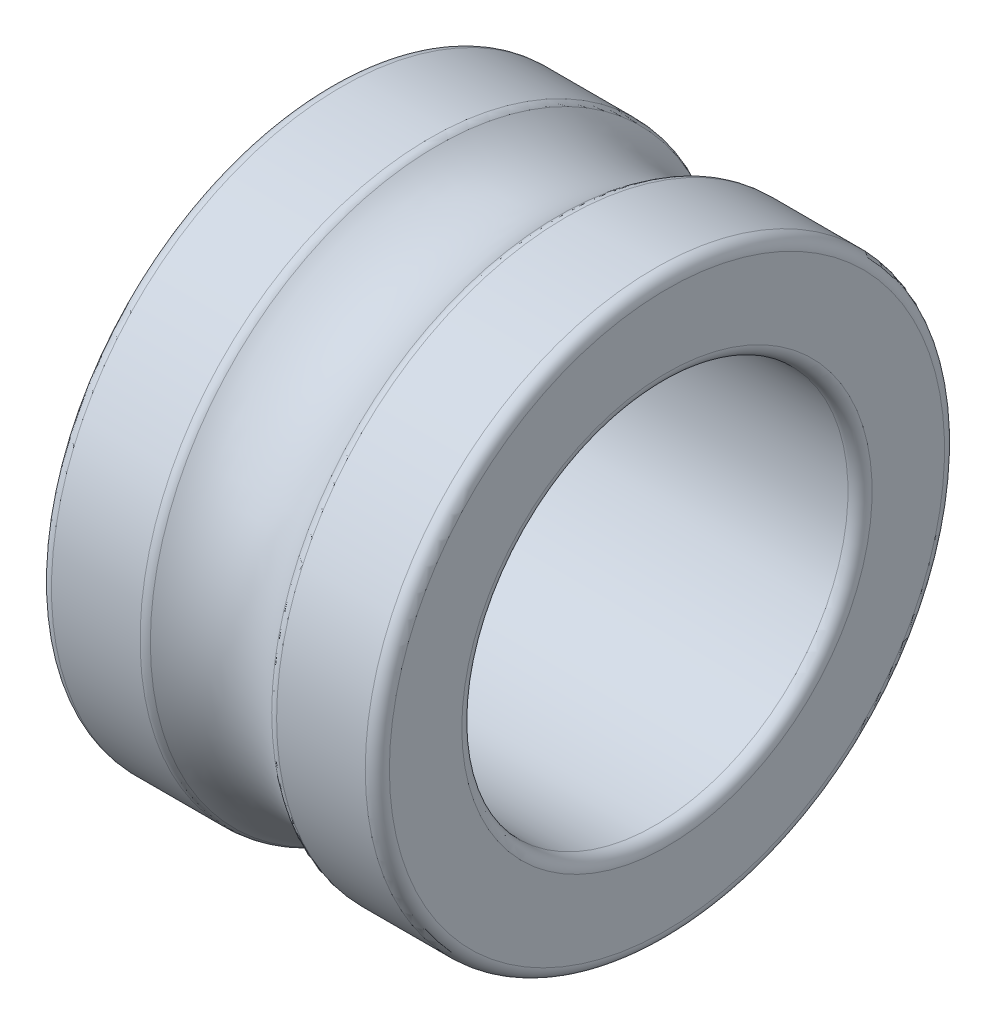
from build123d import *

# Parameters (mm, degrees)
CONG_1_R = 0.25


with BuildPart() as part:
    # Esquisse1 → R_volution1 (revolve)
    with BuildSketch(Plane.XY, mode=Mode.PRIVATE) as r_volution1_sk:
        with BuildLine():
            Line((1.322875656, 6), (3.5, 6))
            Line((3.5, 6), (3.5, 4))
            Line((3.5, 4), (-3.5, 4))
            Line((-3.5, 4), (-3.5, 6))
            Line((-3.5, 6), (-1.322875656, 6))
            ThreePointArc((-1.322875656, 6), (0, 5.5), (1.322875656, 6))
        make_face()
    revolve(r_volution1_sk.sketch.rotate(Axis((-31.667666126, 0, 0), (1, 0, 0)), 90), axis=Axis((-31.667666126, 0, 0), (1, 0, 0)))

    # Cong_1
    cong_1_edges = [part.edges().sort_by_distance(p)[0] for p in [
        (1.322875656, 0, -6),
        (3.5, 0, -6),
        (3.5, 0, -4),
        (-3.5, 0, -4),
        (-3.5, 0, -6),
        (-1.322875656, 0, -6),
    ]]
    fillet(cong_1_edges, radius=CONG_1_R)


solid = part.part
